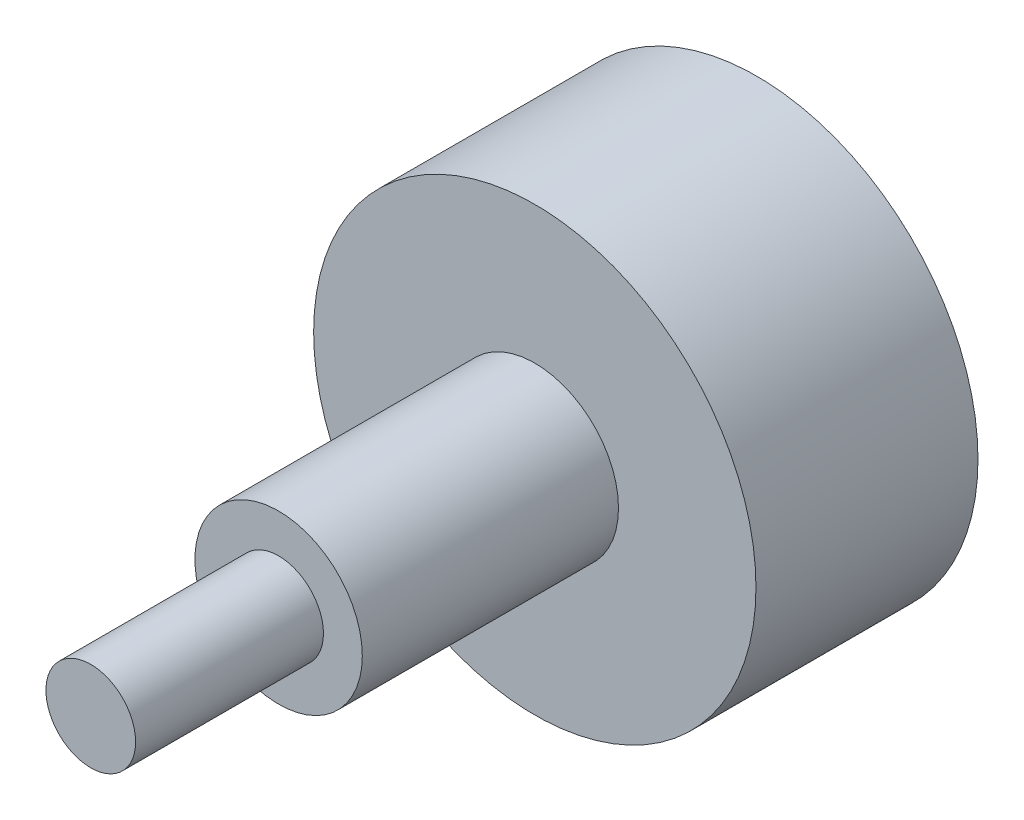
from build123d import *

# Parameters (mm, degrees)
SKETCH2_R           = 12.5
BOSS_EXTRUDE1_DEPTH = 13
SKETCH3_R           = 2.45
BOSS_EXTRUDE2_DEPTH = 26
SKETCH4_R           = 12.9
BOSS_EXTRUDE3_DEPTH = 13
SKETCH5_R           = 2.625
BOSS_EXTRUDE4_DEPTH = 26
SKETCH6_R           = 4.9
BOSS_EXTRUDE5_DEPTH = 15
SKETCH7_R           = 13.125
BOSS_EXTRUDE6_DEPTH = 13
SKETCH8_R           = 13.125
SKETCH8_R_2         = 12.95
CUT_EXTRUDE1_DEPTH  = 44.191796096


with BuildPart() as part:
    # Sketch2 → Boss-Extrude1 (new body)
    with BuildSketch(Plane.XY):
        with Locations(Location((0, 0, 0), (0, 0, 180))):
            Circle(SKETCH2_R)
    extrude(amount=BOSS_EXTRUDE1_DEPTH)

    # Sketch3 → Boss-Extrude2 (add)
    with BuildSketch(Plane.XY.offset(13)):
        with Locations(Location((0, 0, 0), (0, 0, 180))):
            Circle(SKETCH3_R)
    extrude(amount=BOSS_EXTRUDE2_DEPTH)

    # Sketch4 → Boss-Extrude3 (add)
    with BuildSketch(Plane(origin=(0, 0, 0), x_dir=(-1, 0, 0), z_dir=(0, 0, -1))):
        Circle(SKETCH4_R)
    extrude(amount=-BOSS_EXTRUDE3_DEPTH)

    # Sketch5 → Boss-Extrude4 (add)
    with BuildSketch(Plane.XY.offset(39)):
        Circle(SKETCH5_R)
    extrude(amount=-BOSS_EXTRUDE4_DEPTH)

    # Sketch6 → Boss-Extrude5 (add)
    with BuildSketch(Plane.XY.offset(13)):
        Circle(SKETCH6_R)
    extrude(amount=BOSS_EXTRUDE5_DEPTH)

    # Sketch7 → Boss-Extrude6 (add)
    with BuildSketch(Plane(origin=(0, 0, 0), x_dir=(-1, 0, 0), z_dir=(0, 0, -1))):
        Circle(SKETCH7_R)
    extrude(amount=-BOSS_EXTRUDE6_DEPTH)

    # Sketch8 → Cut-Extrude1 (cut, through all)
    with BuildSketch(Plane(origin=(0, 0, 0), x_dir=(-1, 0, 0), z_dir=(0, 0, -1))):
        Circle(SKETCH8_R)
        Circle(SKETCH8_R_2, mode=Mode.SUBTRACT)
    extrude(amount=-CUT_EXTRUDE1_DEPTH, mode=Mode.SUBTRACT)


solid = part.part
